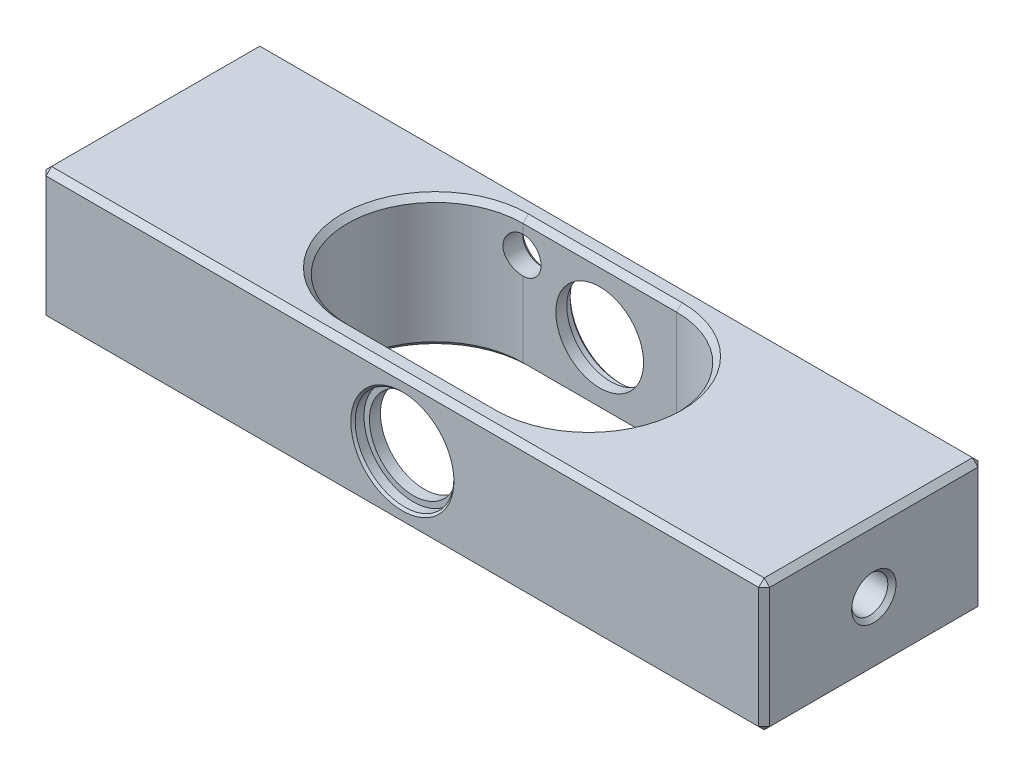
from build123d import *

# Parameters (mm, degrees)
SKETCH_1_W          = 66
SKETCH_1_H          = 20
EXTRUDE_1_DEPTH     = 12
CUT_EXTRUDE_1_DEPTH = 71
CHAMFER_1_SIZE      = 0.5
SKETCH_4_R          = 4
CUT_EXTRUDE_2_DEPTH = 71
SKETCH_5_R          = 4.5
CUT_EXTRUDE_3_DEPTH = 1
CUT_EXTRUDE_START   = -1
SKETCH_6_R          = 4.5
CUT_EXTRUDE_4_DEPTH = 1
M4X0_72_D           = 3.3
M4X0_72_DEPTH       = 11.5
M4X0_72_CSINK_D     = 4.05
M4X0_72_CSINK_ANGLE = 90
M4X0_72_TIP         = 0.991420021
M4X0_73_D           = 3.3
M4X0_73_DEPTH       = 11.5
M4X0_73_CSINK_D     = 4.05
M4X0_73_CSINK_ANGLE = 90
M4X0_73_TIP         = 0.991420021
M4X0_75_D           = 3.3
M4X0_75_DEPTH       = 2.5
M4X0_75_CSINK_D     = 4.05
M4X0_75_CSINK_ANGLE = 90
M4X0_75_TIP         = 0.991420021
CHAMFER_2_SIZE      = 0.2


with BuildPart() as part:
    # Sketch 1 → Extrude 1 (new body)
    with BuildSketch(Plane(origin=(0, 0, 0), x_dir=(1, 0, 0), z_dir=(0, 1, 0))):
        with Locations((33, 10)):
            Rectangle(SKETCH_1_W, SKETCH_1_H)
    extrude(amount=EXTRUDE_1_DEPTH)

    # Sketch 3 → Cut-Extrude 1 (cut, through all)
    with BuildSketch(Plane(origin=(0, 12, 0), x_dir=(1, 0, 0), z_dir=(0, 1, 0))):
        with BuildLine():
            Line((40, 18), (26, 18))
            ThreePointArc((26, 18), (18, 10), (26, 2))
            Line((26, 2), (40, 2))
            ThreePointArc((40, 2), (48, 10), (40, 18))
        make_face()
    extrude(amount=-CUT_EXTRUDE_1_DEPTH, mode=Mode.SUBTRACT)

    # Chamfer 1
    chamfer_1_edges = [part.edges().sort_by_distance(p)[0] for p in [
        (66, 12, -10),
        (33, 12, -20),
        (48, 0, -10),
        (33, 0, -2),
        (18, 0, -10),
        (33, 0, -18),
        (48, 12, -10),
        (33, 12, -18),
        (18, 12, -10),
        (33, 12, -2),
        (0, 12, -10),
        (33, 0, -20),
        (66, 0, -10),
        (33, 0, 0),
        (0, 0, -10),
        (33, 12, 0),
        (0, 6, -20),
        (66, 6, -20),
        (66, 6, 0),
        (0, 6, 0),
    ]]
    chamfer(chamfer_1_edges, length=CHAMFER_1_SIZE)

    # Sketch 4 → Cut-Extrude 2 (cut, through all)
    with BuildSketch(Plane(origin=(0, 0, -20), x_dir=(-1, 0, 0), z_dir=(0, 0, -1))):
        with Locations((-33, 6)):
            Circle(SKETCH_4_R)
    extrude(amount=-CUT_EXTRUDE_2_DEPTH, mode=Mode.SUBTRACT)

    # Sketch 5 → Cut-Extrude 3 (cut)
    with BuildSketch(Plane.XY):
        with Locations((33, 6)):
            Circle(SKETCH_5_R)
    extrude(amount=-CUT_EXTRUDE_3_DEPTH, mode=Mode.SUBTRACT)

    # Sketch 6 → Cut-Extrude 4 (cut)
    with BuildSketch(Plane(origin=(0, 0, -20), x_dir=(-1, 0, 0), z_dir=(0, 0, -1)).offset(CUT_EXTRUDE_START)):
        with Locations(Location((-33, 6, 0), (0, 0, 180))):
            Circle(SKETCH_6_R)
    extrude(amount=CUT_EXTRUDE_4_DEPTH, mode=Mode.SUBTRACT)

    # M4x0.72
    with Locations(Plane.ZY):
        with Locations((-10, 6)):
            CounterSinkHole(M4X0_72_D / 2, M4X0_72_CSINK_D / 2, depth=M4X0_72_DEPTH, counter_sink_angle=M4X0_72_CSINK_ANGLE)
            with Locations((0, 0, -(M4X0_72_DEPTH + M4X0_72_TIP / 2))):  # 118° drill point
                Cone(0, M4X0_72_D / 2, M4X0_72_TIP, mode=Mode.SUBTRACT)

    # M4x0.73
    with Locations(Plane(origin=(66, 0, 0), x_dir=(0, 0, -1), z_dir=(1, 0, 0))):
        with Locations((10, 6)):
            CounterSinkHole(M4X0_73_D / 2, M4X0_73_CSINK_D / 2, depth=M4X0_73_DEPTH, counter_sink_angle=M4X0_73_CSINK_ANGLE)
            with Locations((0, 0, -(M4X0_73_DEPTH + M4X0_73_TIP / 2))):  # 118° drill point
                Cone(0, M4X0_73_D / 2, M4X0_73_TIP, mode=Mode.SUBTRACT)

    # M4x0.75
    with Locations(Plane(origin=(0, 0, -20), x_dir=(-1, 0, 0), z_dir=(0, 0, -1))):
        with Locations((-26, 9)):
            CounterSinkHole(M4X0_75_D / 2, M4X0_75_CSINK_D / 2, depth=M4X0_75_DEPTH, counter_sink_angle=M4X0_75_CSINK_ANGLE)
            with Locations((0, 0, -(M4X0_75_DEPTH + M4X0_75_TIP / 2))):  # 118° drill point
                Cone(0, M4X0_75_D / 2, M4X0_75_TIP, mode=Mode.SUBTRACT)

    # Chamfer 2
    chamfer_2_edges = [part.edges().sort_by_distance(p)[0] for p in [
        (28.5, 6, 0),
        (28.5, 6, -20),
    ]]
    chamfer(chamfer_2_edges, length=CHAMFER_2_SIZE)


solid = part.part
